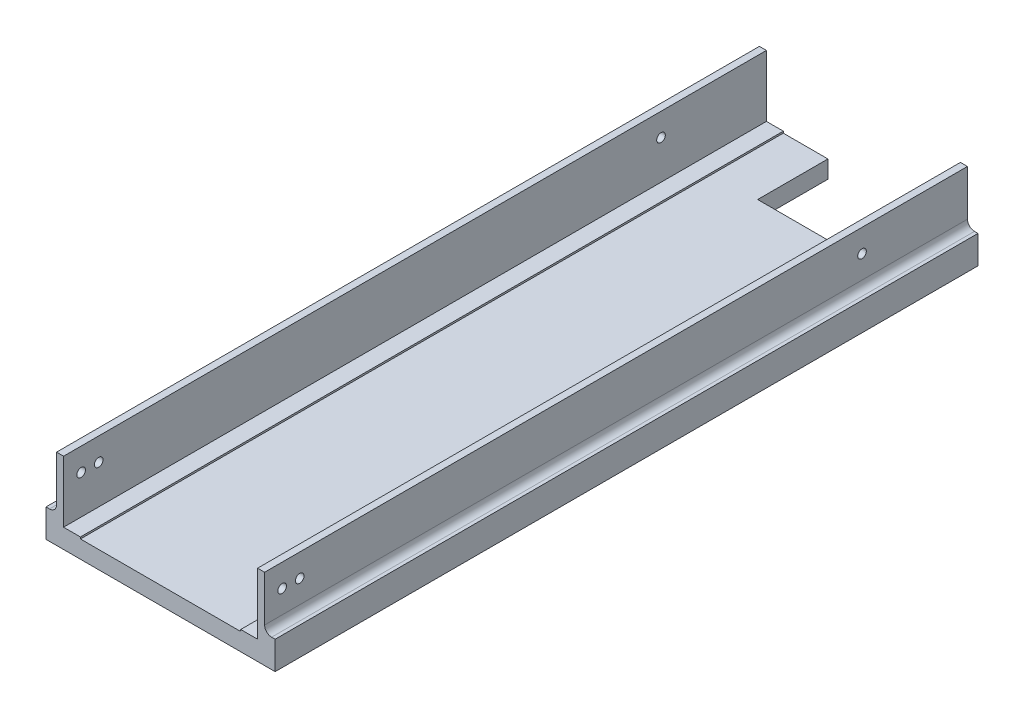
ISO-10303-21;
HEADER;
FILE_DESCRIPTION(('STEP AP214'),'2;1');
FILE_NAME('part.step','',(''),(''),'','','');
FILE_SCHEMA(('AUTOMOTIVE_DESIGN { 1 0 10303 214 1 1 1 1 }'));
ENDSEC;
DATA;
#1=APPLICATION_CONTEXT('core data for automotive mechanical design processes');
#2=APPLICATION_PROTOCOL_DEFINITION('international standard','automotive_design',2000,#1);
#3=PRODUCT_CONTEXT('',#1,'mechanical');
#4=PRODUCT('Part','Part','',(#3));
#5=PRODUCT_RELATED_PRODUCT_CATEGORY('part','',(#4));
#6=PRODUCT_DEFINITION_FORMATION('','',#4);
#7=PRODUCT_DEFINITION_CONTEXT('part definition',#1,'design');
#8=PRODUCT_DEFINITION('design','',#6,#7);
#9=PRODUCT_DEFINITION_SHAPE('','',#8);
#10=(LENGTH_UNIT() NAMED_UNIT(*) SI_UNIT(.MILLI.,.METRE.));
#11=(NAMED_UNIT(*) PLANE_ANGLE_UNIT() SI_UNIT($,.RADIAN.));
#12=(NAMED_UNIT(*) SI_UNIT($,.STERADIAN.) SOLID_ANGLE_UNIT());
#13=UNCERTAINTY_MEASURE_WITH_UNIT(LENGTH_MEASURE(1.E-05),#10,'distance_accuracy_value','');
#14=(GEOMETRIC_REPRESENTATION_CONTEXT(3) GLOBAL_UNCERTAINTY_ASSIGNED_CONTEXT((#13)) GLOBAL_UNIT_ASSIGNED_CONTEXT((#10,
#11,#12)) REPRESENTATION_CONTEXT('',''));
#15=CARTESIAN_POINT('',(0.,0.,0.));
#16=DIRECTION('',(0.,0.,1.));
#17=DIRECTION('',(1.,0.,0.));
#18=AXIS2_PLACEMENT_3D('',#15,#16,#17);
#19=CARTESIAN_POINT('',(9.8,13.,0.));
#20=DIRECTION('',(-1.,0.,0.));
#21=DIRECTION('',(0.,0.,1.));
#22=AXIS2_PLACEMENT_3D('',#19,#20,#21);
#23=PLANE('',#22);
#24=DIRECTION('',(0.,0.,-1.));
#25=VECTOR('',#24,1.);
#26=CARTESIAN_POINT('',(9.8,4.99999999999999,0.));
#27=LINE('',#26,#25);
#28=CARTESIAN_POINT('',(9.80000000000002,4.99999999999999,400.));
#29=VERTEX_POINT('',#28);
#30=CARTESIAN_POINT('',(9.80000000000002,4.99999999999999,200.));
#31=VERTEX_POINT('',#30);
#32=EDGE_CURVE('E310',#29,#31,#27,.T.);
#33=ORIENTED_EDGE('',*,*,#32,.T.);
#34=DIRECTION('',(0.,1.,0.));
#35=VECTOR('',#34,1.);
#36=CARTESIAN_POINT('',(9.80000000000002,13.,200.));
#37=LINE('',#36,#35);
#38=CARTESIAN_POINT('',(9.80000000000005,5.49999999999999,200.));
#39=VERTEX_POINT('',#38);
#40=EDGE_CURVE('E360',#31,#39,#37,.T.);
#41=ORIENTED_EDGE('',*,*,#40,.T.);
#42=DIRECTION('',(0.,0.,-1.));
#43=VECTOR('',#42,1.);
#44=CARTESIAN_POINT('',(9.80000000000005,5.49999999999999,0.));
#45=LINE('',#44,#43);
#46=CARTESIAN_POINT('',(9.80000000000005,5.49999999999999,400.));
#47=VERTEX_POINT('',#46);
#48=EDGE_CURVE('E229',#47,#39,#45,.T.);
#49=ORIENTED_EDGE('',*,*,#48,.F.);
#50=DIRECTION('',(0.,-1.,0.));
#51=VECTOR('',#50,1.);
#52=CARTESIAN_POINT('',(9.80000000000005,13.,400.));
#53=LINE('',#52,#51);
#54=EDGE_CURVE('E313',#47,#29,#53,.T.);
#55=ORIENTED_EDGE('',*,*,#54,.T.);
#56=EDGE_LOOP('',(#33,#41,#49,#55));
#57=FACE_BOUND('',#56,.T.);
#58=ADVANCED_FACE('F38',(#57),#23,.F.);
#59=CARTESIAN_POINT('',(5.,4.99999999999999,400.));
#60=DIRECTION('',(0.,-1.,0.));
#61=DIRECTION('',(0.,0.,-1.));
#62=AXIS2_PLACEMENT_3D('',#59,#60,#61);
#63=PLANE('',#62);
#64=DIRECTION('',(0.,0.,1.));
#65=VECTOR('',#64,1.);
#66=CARTESIAN_POINT('',(55.4,4.99999999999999,0.));
#67=LINE('',#66,#65);
#68=CARTESIAN_POINT('',(55.4,4.99999999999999,200.));
#69=VERTEX_POINT('',#68);
#70=CARTESIAN_POINT('',(55.4,4.99999999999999,400.));
#71=VERTEX_POINT('',#70);
#72=EDGE_CURVE('E308',#69,#71,#67,.T.);
#73=ORIENTED_EDGE('',*,*,#72,.F.);
#74=DIRECTION('',(-1.,0.,0.));
#75=VECTOR('',#74,1.);
#76=CARTESIAN_POINT('',(5.,4.99999999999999,200.));
#77=LINE('',#76,#75);
#78=CARTESIAN_POINT('',(42.7,4.99999999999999,200.));
#79=VERTEX_POINT('',#78);
#80=EDGE_CURVE('E381',#69,#79,#77,.T.);
#81=ORIENTED_EDGE('',*,*,#80,.T.);
#82=DIRECTION('',(0.,0.,-1.));
#83=VECTOR('',#82,1.);
#84=CARTESIAN_POINT('',(42.6999999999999,4.99999999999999,400.));
#85=LINE('',#84,#83);
#86=CARTESIAN_POINT('',(42.7,4.99999999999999,220.));
#87=VERTEX_POINT('',#86);
#88=EDGE_CURVE('E390',#87,#79,#85,.T.);
#89=ORIENTED_EDGE('',*,*,#88,.F.);
#90=DIRECTION('',(-1.,0.,0.));
#91=VECTOR('',#90,1.);
#92=CARTESIAN_POINT('',(5.,4.99999999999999,220.));
#93=LINE('',#92,#91);
#94=CARTESIAN_POINT('',(22.5,4.99999999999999,220.));
#95=VERTEX_POINT('',#94);
#96=EDGE_CURVE('E387',#87,#95,#93,.T.);
#97=ORIENTED_EDGE('',*,*,#96,.T.);
#98=DIRECTION('',(0.,0.,-1.));
#99=VECTOR('',#98,1.);
#100=CARTESIAN_POINT('',(22.5,4.99999999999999,400.));
#101=LINE('',#100,#99);
#102=CARTESIAN_POINT('',(22.5,4.99999999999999,200.));
#103=VERTEX_POINT('',#102);
#104=EDGE_CURVE('E384',#95,#103,#101,.T.);
#105=ORIENTED_EDGE('',*,*,#104,.T.);
#106=DIRECTION('',(-1.,0.,0.));
#107=VECTOR('',#106,1.);
#108=CARTESIAN_POINT('',(5.,4.99999999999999,200.));
#109=LINE('',#108,#107);
#110=EDGE_CURVE('E363',#103,#31,#109,.T.);
#111=ORIENTED_EDGE('',*,*,#110,.T.);
#112=ORIENTED_EDGE('',*,*,#32,.F.);
#113=DIRECTION('',(-1.,0.,0.));
#114=VECTOR('',#113,1.);
#115=CARTESIAN_POINT('',(5.,4.99999999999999,400.));
#116=LINE('',#115,#114);
#117=EDGE_CURVE('E330',#71,#29,#116,.T.);
#118=ORIENTED_EDGE('',*,*,#117,.F.);
#119=EDGE_LOOP('',(#73,#81,#89,#97,#105,#111,#112,#118));
#120=FACE_BOUND('',#119,.T.);
#121=ADVANCED_FACE('F433',(#120),#63,.F.);
#122=CARTESIAN_POINT('',(5.,25.,400.));
#123=DIRECTION('',(-1.,0.,0.));
#124=DIRECTION('',(0.,-1.,0.));
#125=AXIS2_PLACEMENT_3D('',#122,#123,#124);
#126=PLANE('',#125);
#127=CARTESIAN_POINT('',(5.,16.5,230.));
#128=DIRECTION('',(-1.,0.,0.));
#129=DIRECTION('',(0.,-1.,0.));
#130=AXIS2_PLACEMENT_3D('',#127,#128,#129);
#131=CIRCLE('',#130,1.225);
#132=CARTESIAN_POINT('',(5.,15.275,230.));
#133=VERTEX_POINT('',#132);
#134=EDGE_CURVE('E237',#133,#133,#131,.T.);
#135=ORIENTED_EDGE('',*,*,#134,.T.);
#136=EDGE_LOOP('',(#135));
#137=FACE_BOUND('',#136,.T.);
#138=CARTESIAN_POINT('',(5.,16.5,390.));
#139=DIRECTION('',(-1.,0.,0.));
#140=DIRECTION('',(0.,-1.,0.));
#141=AXIS2_PLACEMENT_3D('',#138,#139,#140);
#142=CIRCLE('',#141,1.225);
#143=CARTESIAN_POINT('',(5.,15.275,390.));
#144=VERTEX_POINT('',#143);
#145=EDGE_CURVE('E233',#144,#144,#142,.T.);
#146=ORIENTED_EDGE('',*,*,#145,.T.);
#147=EDGE_LOOP('',(#146));
#148=FACE_BOUND('',#147,.T.);
#149=CARTESIAN_POINT('',(5.,16.5,395.));
#150=DIRECTION('',(-1.,0.,0.));
#151=DIRECTION('',(0.,-1.,0.));
#152=AXIS2_PLACEMENT_3D('',#149,#150,#151);
#153=CIRCLE('',#152,1.225);
#154=CARTESIAN_POINT('',(5.,15.275,395.));
#155=VERTEX_POINT('',#154);
#156=EDGE_CURVE('E228',#155,#155,#153,.T.);
#157=ORIENTED_EDGE('',*,*,#156,.T.);
#158=EDGE_LOOP('',(#157));
#159=FACE_BOUND('',#158,.T.);
#160=DIRECTION('',(0.,0.,1.));
#161=VECTOR('',#160,1.);
#162=CARTESIAN_POINT('',(5.,5.49999999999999,0.));
#163=LINE('',#162,#161);
#164=CARTESIAN_POINT('',(5.,5.49999999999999,200.));
#165=VERTEX_POINT('',#164);
#166=CARTESIAN_POINT('',(5.,5.49999999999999,400.));
#167=VERTEX_POINT('',#166);
#168=EDGE_CURVE('E288',#165,#167,#163,.T.);
#169=ORIENTED_EDGE('',*,*,#168,.F.);
#170=DIRECTION('',(0.,1.,0.));
#171=VECTOR('',#170,1.);
#172=CARTESIAN_POINT('',(5.,25.,200.));
#173=LINE('',#172,#171);
#174=CARTESIAN_POINT('',(5.,23.,200.));
#175=VERTEX_POINT('',#174);
#176=EDGE_CURVE('E344',#165,#175,#173,.T.);
#177=ORIENTED_EDGE('',*,*,#176,.T.);
#178=DIRECTION('',(0.,0.,-1.));
#179=VECTOR('',#178,1.);
#180=CARTESIAN_POINT('',(5.,23.,400.));
#181=LINE('',#180,#179);
#182=CARTESIAN_POINT('',(5.,23.,400.));
#183=VERTEX_POINT('',#182);
#184=EDGE_CURVE('E320',#183,#175,#181,.T.);
#185=ORIENTED_EDGE('',*,*,#184,.F.);
#186=DIRECTION('',(0.,1.,0.));
#187=VECTOR('',#186,1.);
#188=CARTESIAN_POINT('',(5.,25.,400.));
#189=LINE('',#188,#187);
#190=EDGE_CURVE('E221',#167,#183,#189,.T.);
#191=ORIENTED_EDGE('',*,*,#190,.F.);
#192=EDGE_LOOP('',(#169,#177,#185,#191));
#193=FACE_BOUND('',#192,.T.);
#194=ADVANCED_FACE('F343',(#137,#148,#159,#193),#126,.F.);
#195=CARTESIAN_POINT('',(0.,0.,400.));
#196=DIRECTION('',(1.,0.,0.));
#197=DIRECTION('',(0.,0.,-1.));
#198=AXIS2_PLACEMENT_3D('',#195,#196,#197);
#199=PLANE('',#198);
#200=DIRECTION('',(0.,0.,-1.));
#201=VECTOR('',#200,1.);
#202=CARTESIAN_POINT('',(0.,7.99999999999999,400.));
#203=LINE('',#202,#201);
#204=CARTESIAN_POINT('',(0.,7.99999999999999,400.));
#205=VERTEX_POINT('',#204);
#206=CARTESIAN_POINT('',(0.,7.99999999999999,200.));
#207=VERTEX_POINT('',#206);
#208=EDGE_CURVE('E207',#205,#207,#203,.T.);
#209=ORIENTED_EDGE('',*,*,#208,.T.);
#210=DIRECTION('',(0.,1.,0.));
#211=VECTOR('',#210,1.);
#212=CARTESIAN_POINT('',(0.,0.,200.));
#213=LINE('',#212,#211);
#214=CARTESIAN_POINT('',(0.,0.,200.));
#215=VERTEX_POINT('',#214);
#216=EDGE_CURVE('E189',#215,#207,#213,.T.);
#217=ORIENTED_EDGE('',*,*,#216,.F.);
#218=DIRECTION('',(0.,0.,-1.));
#219=VECTOR('',#218,1.);
#220=CARTESIAN_POINT('',(0.,0.,400.));
#221=LINE('',#220,#219);
#222=CARTESIAN_POINT('',(0.,0.,400.));
#223=VERTEX_POINT('',#222);
#224=EDGE_CURVE('E204',#223,#215,#221,.T.);
#225=ORIENTED_EDGE('',*,*,#224,.F.);
#226=DIRECTION('',(0.,-1.,0.));
#227=VECTOR('',#226,1.);
#228=CARTESIAN_POINT('',(0.,0.,400.));
#229=LINE('',#228,#227);
#230=EDGE_CURVE('E216',#205,#223,#229,.T.);
#231=ORIENTED_EDGE('',*,*,#230,.F.);
#232=EDGE_LOOP('',(#209,#217,#225,#231));
#233=FACE_BOUND('',#232,.T.);
#234=ADVANCED_FACE('F202',(#233),#199,.F.);
#235=CARTESIAN_POINT('',(65.2,25.,400.));
#236=DIRECTION('',(-1.,0.,0.));
#237=DIRECTION('',(0.,0.,1.));
#238=AXIS2_PLACEMENT_3D('',#235,#236,#237);
#239=PLANE('',#238);
#240=DIRECTION('',(0.,0.,-1.));
#241=VECTOR('',#240,1.);
#242=CARTESIAN_POINT('',(65.2,0.,400.));
#243=LINE('',#242,#241);
#244=CARTESIAN_POINT('',(65.2,0.,400.));
#245=VERTEX_POINT('',#244);
#246=CARTESIAN_POINT('',(65.2,0.,200.));
#247=VERTEX_POINT('',#246);
#248=EDGE_CURVE('E215',#245,#247,#243,.T.);
#249=ORIENTED_EDGE('',*,*,#248,.T.);
#250=DIRECTION('',(0.,1.,0.));
#251=VECTOR('',#250,1.);
#252=CARTESIAN_POINT('',(65.2,0.,200.));
#253=LINE('',#252,#251);
#254=CARTESIAN_POINT('',(65.2,7.99999999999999,200.));
#255=VERTEX_POINT('',#254);
#256=EDGE_CURVE('E356',#247,#255,#253,.T.);
#257=ORIENTED_EDGE('',*,*,#256,.T.);
#258=DIRECTION('',(0.,0.,-1.));
#259=VECTOR('',#258,1.);
#260=CARTESIAN_POINT('',(65.2,7.99999999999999,400.));
#261=LINE('',#260,#259);
#262=CARTESIAN_POINT('',(65.2,7.99999999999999,400.));
#263=VERTEX_POINT('',#262);
#264=EDGE_CURVE('E395',#263,#255,#261,.T.);
#265=ORIENTED_EDGE('',*,*,#264,.F.);
#266=DIRECTION('',(0.,1.,0.));
#267=VECTOR('',#266,1.);
#268=CARTESIAN_POINT('',(65.2,25.,400.));
#269=LINE('',#268,#267);
#270=EDGE_CURVE('E325',#245,#263,#269,.T.);
#271=ORIENTED_EDGE('',*,*,#270,.F.);
#272=EDGE_LOOP('',(#249,#257,#265,#271));
#273=FACE_BOUND('',#272,.T.);
#274=ADVANCED_FACE('F405',(#273),#239,.F.);
#275=CARTESIAN_POINT('',(60.2,4.99999999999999,400.));
#276=DIRECTION('',(1.,0.,0.));
#277=DIRECTION('',(0.,0.,-1.));
#278=AXIS2_PLACEMENT_3D('',#275,#276,#277);
#279=PLANE('',#278);
#280=CARTESIAN_POINT('',(60.2,16.5,230.));
#281=DIRECTION('',(1.,0.,0.));
#282=DIRECTION('',(0.,0.,-1.));
#283=AXIS2_PLACEMENT_3D('',#280,#281,#282);
#284=CIRCLE('',#283,1.225);
#285=CARTESIAN_POINT('',(60.2,16.5,228.775));
#286=VERTEX_POINT('',#285);
#287=EDGE_CURVE('E234',#286,#286,#284,.T.);
#288=ORIENTED_EDGE('',*,*,#287,.T.);
#289=EDGE_LOOP('',(#288));
#290=FACE_BOUND('',#289,.T.);
#291=CARTESIAN_POINT('',(60.2,16.5,390.));
#292=DIRECTION('',(1.,0.,0.));
#293=DIRECTION('',(0.,0.,-1.));
#294=AXIS2_PLACEMENT_3D('',#291,#292,#293);
#295=CIRCLE('',#294,1.225);
#296=CARTESIAN_POINT('',(60.2,16.5,388.775));
#297=VERTEX_POINT('',#296);
#298=EDGE_CURVE('E230',#297,#297,#295,.T.);
#299=ORIENTED_EDGE('',*,*,#298,.T.);
#300=EDGE_LOOP('',(#299));
#301=FACE_BOUND('',#300,.T.);
#302=CARTESIAN_POINT('',(60.2,16.5,395.));
#303=DIRECTION('',(1.,0.,0.));
#304=DIRECTION('',(0.,0.,-1.));
#305=AXIS2_PLACEMENT_3D('',#302,#303,#304);
#306=CIRCLE('',#305,1.225);
#307=CARTESIAN_POINT('',(60.2,16.5,393.775));
#308=VERTEX_POINT('',#307);
#309=EDGE_CURVE('E225',#308,#308,#306,.T.);
#310=ORIENTED_EDGE('',*,*,#309,.T.);
#311=EDGE_LOOP('',(#310));
#312=FACE_BOUND('',#311,.T.);
#313=DIRECTION('',(0.,0.,1.));
#314=VECTOR('',#313,1.);
#315=CARTESIAN_POINT('',(60.2,23.,400.));
#316=LINE('',#315,#314);
#317=CARTESIAN_POINT('',(60.2,23.,200.));
#318=VERTEX_POINT('',#317);
#319=CARTESIAN_POINT('',(60.2,23.,400.));
#320=VERTEX_POINT('',#319);
#321=EDGE_CURVE('E315',#318,#320,#316,.T.);
#322=ORIENTED_EDGE('',*,*,#321,.F.);
#323=DIRECTION('',(0.,-1.,0.));
#324=VECTOR('',#323,1.);
#325=CARTESIAN_POINT('',(60.2,4.99999999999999,200.));
#326=LINE('',#325,#324);
#327=CARTESIAN_POINT('',(60.2,5.49999999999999,200.));
#328=VERTEX_POINT('',#327);
#329=EDGE_CURVE('E378',#318,#328,#326,.T.);
#330=ORIENTED_EDGE('',*,*,#329,.T.);
#331=DIRECTION('',(0.,0.,-1.));
#332=VECTOR('',#331,1.);
#333=CARTESIAN_POINT('',(60.2,5.49999999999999,400.));
#334=LINE('',#333,#332);
#335=CARTESIAN_POINT('',(60.2,5.49999999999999,400.));
#336=VERTEX_POINT('',#335);
#337=EDGE_CURVE('E287',#336,#328,#334,.T.);
#338=ORIENTED_EDGE('',*,*,#337,.F.);
#339=DIRECTION('',(0.,-1.,0.));
#340=VECTOR('',#339,1.);
#341=CARTESIAN_POINT('',(60.2,4.99999999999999,400.));
#342=LINE('',#341,#340);
#343=EDGE_CURVE('E328',#320,#336,#342,.T.);
#344=ORIENTED_EDGE('',*,*,#343,.F.);
#345=EDGE_LOOP('',(#322,#330,#338,#344));
#346=FACE_BOUND('',#345,.T.);
#347=ADVANCED_FACE('F457',(#290,#301,#312,#346),#279,.F.);
#348=CARTESIAN_POINT('',(0.,0.,400.));
#349=DIRECTION('',(0.,0.,-1.));
#350=DIRECTION('',(-1.,0.,0.));
#351=AXIS2_PLACEMENT_3D('',#348,#349,#350);
#352=PLANE('',#351);
#353=DIRECTION('',(-1.,0.,0.));
#354=VECTOR('',#353,1.);
#355=CARTESIAN_POINT('',(65.2,7.99999999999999,400.));
#356=LINE('',#355,#354);
#357=CARTESIAN_POINT('',(64.2,7.99999999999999,400.));
#358=VERTEX_POINT('',#357);
#359=EDGE_CURVE('E271',#263,#358,#356,.T.);
#360=ORIENTED_EDGE('',*,*,#359,.T.);
#361=CARTESIAN_POINT('',(64.2,9.99999999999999,400.));
#362=DIRECTION('',(0.,0.,-1.));
#363=DIRECTION('',(-1.,0.,0.));
#364=AXIS2_PLACEMENT_3D('',#361,#362,#363);
#365=CIRCLE('',#364,2.);
#366=CARTESIAN_POINT('',(62.2,9.99999999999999,400.));
#367=VERTEX_POINT('',#366);
#368=EDGE_CURVE('E253',#358,#367,#365,.T.);
#369=ORIENTED_EDGE('',*,*,#368,.T.);
#370=DIRECTION('',(0.,1.,0.));
#371=VECTOR('',#370,1.);
#372=CARTESIAN_POINT('',(62.2,23.,400.));
#373=LINE('',#372,#371);
#374=CARTESIAN_POINT('',(62.2,23.,400.));
#375=VERTEX_POINT('',#374);
#376=EDGE_CURVE('E393',#367,#375,#373,.T.);
#377=ORIENTED_EDGE('',*,*,#376,.T.);
#378=DIRECTION('',(1.,0.,0.));
#379=VECTOR('',#378,1.);
#380=CARTESIAN_POINT('',(0.,23.,400.));
#381=LINE('',#380,#379);
#382=EDGE_CURVE('E317',#320,#375,#381,.T.);
#383=ORIENTED_EDGE('',*,*,#382,.F.);
#384=ORIENTED_EDGE('',*,*,#343,.T.);
#385=DIRECTION('',(1.,0.,0.));
#386=VECTOR('',#385,1.);
#387=CARTESIAN_POINT('',(55.4,5.49999999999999,400.));
#388=LINE('',#387,#386);
#389=CARTESIAN_POINT('',(55.4,5.49999999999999,400.));
#390=VERTEX_POINT('',#389);
#391=EDGE_CURVE('E297',#390,#336,#388,.T.);
#392=ORIENTED_EDGE('',*,*,#391,.F.);
#393=DIRECTION('',(0.,-1.,0.));
#394=VECTOR('',#393,1.);
#395=CARTESIAN_POINT('',(55.4,13.,400.));
#396=LINE('',#395,#394);
#397=EDGE_CURVE('E305',#390,#71,#396,.T.);
#398=ORIENTED_EDGE('',*,*,#397,.T.);
#399=ORIENTED_EDGE('',*,*,#117,.T.);
#400=ORIENTED_EDGE('',*,*,#54,.F.);
#401=DIRECTION('',(1.,0.,0.));
#402=VECTOR('',#401,1.);
#403=CARTESIAN_POINT('',(5.,5.49999999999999,400.));
#404=LINE('',#403,#402);
#405=EDGE_CURVE('E290',#167,#47,#404,.T.);
#406=ORIENTED_EDGE('',*,*,#405,.F.);
#407=ORIENTED_EDGE('',*,*,#190,.T.);
#408=CARTESIAN_POINT('',(3.,23.,400.));
#409=VERTEX_POINT('',#408);
#410=EDGE_CURVE('E321',#409,#183,#381,.T.);
#411=ORIENTED_EDGE('',*,*,#410,.F.);
#412=DIRECTION('',(0.,-1.,0.));
#413=VECTOR('',#412,1.);
#414=CARTESIAN_POINT('',(3.,23.,400.));
#415=LINE('',#414,#413);
#416=CARTESIAN_POINT('',(3.,9.99999999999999,400.));
#417=VERTEX_POINT('',#416);
#418=EDGE_CURVE('E268',#409,#417,#415,.T.);
#419=ORIENTED_EDGE('',*,*,#418,.T.);
#420=CARTESIAN_POINT('',(0.999999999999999,9.99999999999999,400.));
#421=DIRECTION('',(0.,0.,-1.));
#422=DIRECTION('',(-1.,0.,0.));
#423=AXIS2_PLACEMENT_3D('',#420,#421,#422);
#424=CIRCLE('',#423,2.);
#425=CARTESIAN_POINT('',(0.999999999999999,7.99999999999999,400.));
#426=VERTEX_POINT('',#425);
#427=EDGE_CURVE('E259',#417,#426,#424,.T.);
#428=ORIENTED_EDGE('',*,*,#427,.T.);
#429=DIRECTION('',(-1.,0.,0.));
#430=VECTOR('',#429,1.);
#431=CARTESIAN_POINT('',(0.,7.99999999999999,400.));
#432=LINE('',#431,#430);
#433=EDGE_CURVE('E266',#426,#205,#432,.T.);
#434=ORIENTED_EDGE('',*,*,#433,.T.);
#435=ORIENTED_EDGE('',*,*,#230,.T.);
#436=DIRECTION('',(1.,0.,0.));
#437=VECTOR('',#436,1.);
#438=CARTESIAN_POINT('',(65.2,0.,400.));
#439=LINE('',#438,#437);
#440=EDGE_CURVE('E214',#223,#245,#439,.T.);
#441=ORIENTED_EDGE('',*,*,#440,.T.);
#442=ORIENTED_EDGE('',*,*,#270,.T.);
#443=EDGE_LOOP('',(#360,#369,#377,#383,#384,#392,#398,#399,#400,#406,#407,#411,#419,#428,#434,
#435,#441,#442));
#444=FACE_BOUND('',#443,.T.);
#445=ADVANCED_FACE('F338',(#444),#352,.F.);
#446=CARTESIAN_POINT('',(65.2,0.,400.));
#447=DIRECTION('',(0.,1.,0.));
#448=DIRECTION('',(0.,0.,1.));
#449=AXIS2_PLACEMENT_3D('',#446,#447,#448);
#450=PLANE('',#449);
#451=DIRECTION('',(0.,0.,1.));
#452=VECTOR('',#451,1.);
#453=CARTESIAN_POINT('',(42.7000000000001,0.,0.));
#454=LINE('',#453,#452);
#455=CARTESIAN_POINT('',(42.7,0.,200.));
#456=VERTEX_POINT('',#455);
#457=CARTESIAN_POINT('',(42.7,0.,220.));
#458=VERTEX_POINT('',#457);
#459=EDGE_CURVE('E410',#456,#458,#454,.T.);
#460=ORIENTED_EDGE('',*,*,#459,.F.);
#461=DIRECTION('',(1.,0.,0.));
#462=VECTOR('',#461,1.);
#463=CARTESIAN_POINT('',(0.,0.,200.));
#464=LINE('',#463,#462);
#465=EDGE_CURVE('E208',#456,#247,#464,.T.);
#466=ORIENTED_EDGE('',*,*,#465,.T.);
#467=ORIENTED_EDGE('',*,*,#248,.F.);
#468=ORIENTED_EDGE('',*,*,#440,.F.);
#469=ORIENTED_EDGE('',*,*,#224,.T.);
#470=DIRECTION('',(1.,0.,0.));
#471=VECTOR('',#470,1.);
#472=CARTESIAN_POINT('',(0.,0.,200.));
#473=LINE('',#472,#471);
#474=CARTESIAN_POINT('',(22.5,0.,200.));
#475=VERTEX_POINT('',#474);
#476=EDGE_CURVE('E186',#215,#475,#473,.T.);
#477=ORIENTED_EDGE('',*,*,#476,.T.);
#478=DIRECTION('',(0.,0.,1.));
#479=VECTOR('',#478,1.);
#480=CARTESIAN_POINT('',(22.4999999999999,0.,0.));
#481=LINE('',#480,#479);
#482=CARTESIAN_POINT('',(22.5,0.,220.));
#483=VERTEX_POINT('',#482);
#484=EDGE_CURVE('E196',#475,#483,#481,.T.);
#485=ORIENTED_EDGE('',*,*,#484,.T.);
#486=DIRECTION('',(1.,0.,0.));
#487=VECTOR('',#486,1.);
#488=CARTESIAN_POINT('',(0.,0.,220.));
#489=LINE('',#488,#487);
#490=EDGE_CURVE('E414',#483,#458,#489,.T.);
#491=ORIENTED_EDGE('',*,*,#490,.T.);
#492=EDGE_LOOP('',(#460,#466,#467,#468,#469,#477,#485,#491));
#493=FACE_BOUND('',#492,.T.);
#494=ADVANCED_FACE('F211',(#493),#450,.F.);
#495=CARTESIAN_POINT('',(0.,23.,0.));
#496=DIRECTION('',(0.,1.,0.));
#497=DIRECTION('',(0.,0.,1.));
#498=AXIS2_PLACEMENT_3D('',#495,#496,#497);
#499=PLANE('',#498);
#500=DIRECTION('',(1.,0.,0.));
#501=VECTOR('',#500,1.);
#502=CARTESIAN_POINT('',(0.,23.,200.));
#503=LINE('',#502,#501);
#504=CARTESIAN_POINT('',(62.2,23.,200.));
#505=VERTEX_POINT('',#504);
#506=EDGE_CURVE('E197',#318,#505,#503,.T.);
#507=ORIENTED_EDGE('',*,*,#506,.F.);
#508=ORIENTED_EDGE('',*,*,#321,.T.);
#509=ORIENTED_EDGE('',*,*,#382,.T.);
#510=DIRECTION('',(0.,0.,-1.));
#511=VECTOR('',#510,1.);
#512=CARTESIAN_POINT('',(62.2,23.,400.));
#513=LINE('',#512,#511);
#514=EDGE_CURVE('E243',#375,#505,#513,.T.);
#515=ORIENTED_EDGE('',*,*,#514,.T.);
#516=EDGE_LOOP('',(#507,#508,#509,#515));
#517=FACE_BOUND('',#516,.T.);
#518=ADVANCED_FACE('F459',(#517),#499,.T.);
#519=DIRECTION('',(1.,0.,0.));
#520=VECTOR('',#519,1.);
#521=CARTESIAN_POINT('',(0.,23.,200.));
#522=LINE('',#521,#520);
#523=CARTESIAN_POINT('',(3.,23.,200.));
#524=VERTEX_POINT('',#523);
#525=EDGE_CURVE('E349',#524,#175,#522,.T.);
#526=ORIENTED_EDGE('',*,*,#525,.F.);
#527=DIRECTION('',(0.,0.,-1.));
#528=VECTOR('',#527,1.);
#529=CARTESIAN_POINT('',(3.,23.,400.));
#530=LINE('',#529,#528);
#531=EDGE_CURVE('E269',#409,#524,#530,.T.);
#532=ORIENTED_EDGE('',*,*,#531,.F.);
#533=ORIENTED_EDGE('',*,*,#410,.T.);
#534=ORIENTED_EDGE('',*,*,#184,.T.);
#535=EDGE_LOOP('',(#526,#532,#533,#534));
#536=FACE_BOUND('',#535,.T.);
#537=ADVANCED_FACE('F347',(#536),#499,.T.);
#538=CARTESIAN_POINT('',(55.4,13.,0.));
#539=DIRECTION('',(1.,0.,0.));
#540=DIRECTION('',(0.,0.,-1.));
#541=AXIS2_PLACEMENT_3D('',#538,#539,#540);
#542=PLANE('',#541);
#543=DIRECTION('',(0.,0.,1.));
#544=VECTOR('',#543,1.);
#545=CARTESIAN_POINT('',(55.4,5.49999999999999,400.));
#546=LINE('',#545,#544);
#547=CARTESIAN_POINT('',(55.4,5.49999999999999,200.));
#548=VERTEX_POINT('',#547);
#549=EDGE_CURVE('E291',#548,#390,#546,.T.);
#550=ORIENTED_EDGE('',*,*,#549,.F.);
#551=DIRECTION('',(0.,-1.,0.));
#552=VECTOR('',#551,1.);
#553=CARTESIAN_POINT('',(55.4,13.,200.));
#554=LINE('',#553,#552);
#555=EDGE_CURVE('E375',#548,#69,#554,.T.);
#556=ORIENTED_EDGE('',*,*,#555,.T.);
#557=ORIENTED_EDGE('',*,*,#72,.T.);
#558=ORIENTED_EDGE('',*,*,#397,.F.);
#559=EDGE_LOOP('',(#550,#556,#557,#558));
#560=FACE_BOUND('',#559,.T.);
#561=ADVANCED_FACE('F447',(#560),#542,.F.);
#562=CARTESIAN_POINT('',(65.2,16.5,395.));
#563=DIRECTION('',(-1.,0.,0.));
#564=DIRECTION('',(0.,0.,1.));
#565=AXIS2_PLACEMENT_3D('',#562,#563,#564);
#566=CYLINDRICAL_SURFACE('',#565,1.225);
#567=CARTESIAN_POINT('',(62.2,16.5,395.));
#568=DIRECTION('',(-1.,0.,0.));
#569=DIRECTION('',(0.,0.,1.));
#570=AXIS2_PLACEMENT_3D('',#567,#568,#569);
#571=CIRCLE('',#570,1.225);
#572=CARTESIAN_POINT('',(62.2,16.5,396.225));
#573=VERTEX_POINT('',#572);
#574=EDGE_CURVE('E238',#573,#573,#571,.F.);
#575=ORIENTED_EDGE('',*,*,#574,.T.);
#576=EDGE_LOOP('',(#575));
#577=FACE_BOUND('',#576,.T.);
#578=ORIENTED_EDGE('',*,*,#309,.F.);
#579=EDGE_LOOP('',(#578));
#580=FACE_BOUND('',#579,.T.);
#581=ADVANCED_FACE('F516',(#577,#580),#566,.F.);
#582=CARTESIAN_POINT('',(65.2,16.5,390.));
#583=DIRECTION('',(-1.,0.,0.));
#584=DIRECTION('',(0.,0.,1.));
#585=AXIS2_PLACEMENT_3D('',#582,#583,#584);
#586=CYLINDRICAL_SURFACE('',#585,1.225);
#587=CARTESIAN_POINT('',(62.2,16.5,390.));
#588=DIRECTION('',(-1.,0.,0.));
#589=DIRECTION('',(0.,0.,1.));
#590=AXIS2_PLACEMENT_3D('',#587,#588,#589);
#591=CIRCLE('',#590,1.225);
#592=CARTESIAN_POINT('',(62.2,16.5,391.225));
#593=VERTEX_POINT('',#592);
#594=EDGE_CURVE('E247',#593,#593,#591,.F.);
#595=ORIENTED_EDGE('',*,*,#594,.T.);
#596=EDGE_LOOP('',(#595));
#597=FACE_BOUND('',#596,.T.);
#598=ORIENTED_EDGE('',*,*,#298,.F.);
#599=EDGE_LOOP('',(#598));
#600=FACE_BOUND('',#599,.T.);
#601=ADVANCED_FACE('F722',(#597,#600),#586,.F.);
#602=CARTESIAN_POINT('',(3.,16.5,395.));
#603=DIRECTION('',(1.,0.,0.));
#604=DIRECTION('',(0.,1.,0.));
#605=AXIS2_PLACEMENT_3D('',#602,#603,#604);
#606=CIRCLE('',#605,1.225);
#607=CARTESIAN_POINT('',(3.,17.725,395.));
#608=VERTEX_POINT('',#607);
#609=EDGE_CURVE('E248',#608,#608,#606,.F.);
#610=ORIENTED_EDGE('',*,*,#609,.T.);
#611=EDGE_LOOP('',(#610));
#612=FACE_BOUND('',#611,.T.);
#613=ORIENTED_EDGE('',*,*,#156,.F.);
#614=EDGE_LOOP('',(#613));
#615=FACE_BOUND('',#614,.T.);
#616=ADVANCED_FACE('F719',(#612,#615),#566,.F.);
#617=CARTESIAN_POINT('',(3.,16.5,390.));
#618=DIRECTION('',(1.,0.,0.));
#619=DIRECTION('',(0.,1.,0.));
#620=AXIS2_PLACEMENT_3D('',#617,#618,#619);
#621=CIRCLE('',#620,1.225);
#622=CARTESIAN_POINT('',(3.,17.725,390.));
#623=VERTEX_POINT('',#622);
#624=EDGE_CURVE('E242',#623,#623,#621,.F.);
#625=ORIENTED_EDGE('',*,*,#624,.T.);
#626=EDGE_LOOP('',(#625));
#627=FACE_BOUND('',#626,.T.);
#628=ORIENTED_EDGE('',*,*,#145,.F.);
#629=EDGE_LOOP('',(#628));
#630=FACE_BOUND('',#629,.T.);
#631=ADVANCED_FACE('F526',(#627,#630),#586,.F.);
#632=CARTESIAN_POINT('',(0.,5.49999999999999,0.));
#633=DIRECTION('',(0.,1.,0.));
#634=DIRECTION('',(0.,0.,1.));
#635=AXIS2_PLACEMENT_3D('',#632,#633,#634);
#636=PLANE('',#635);
#637=DIRECTION('',(1.,0.,0.));
#638=VECTOR('',#637,1.);
#639=CARTESIAN_POINT('',(0.,5.49999999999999,200.));
#640=LINE('',#639,#638);
#641=EDGE_CURVE('E353',#165,#39,#640,.T.);
#642=ORIENTED_EDGE('',*,*,#641,.F.);
#643=ORIENTED_EDGE('',*,*,#168,.T.);
#644=ORIENTED_EDGE('',*,*,#405,.T.);
#645=ORIENTED_EDGE('',*,*,#48,.T.);
#646=EDGE_LOOP('',(#642,#643,#644,#645));
#647=FACE_BOUND('',#646,.T.);
#648=ADVANCED_FACE('F520',(#647),#636,.T.);
#649=CARTESIAN_POINT('',(0.,5.49999999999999,0.));
#650=DIRECTION('',(0.,-1.,0.));
#651=DIRECTION('',(0.,0.,-1.));
#652=AXIS2_PLACEMENT_3D('',#649,#650,#651);
#653=PLANE('',#652);
#654=ORIENTED_EDGE('',*,*,#337,.T.);
#655=DIRECTION('',(-1.,0.,0.));
#656=VECTOR('',#655,1.);
#657=CARTESIAN_POINT('',(0.,5.49999999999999,200.));
#658=LINE('',#657,#656);
#659=EDGE_CURVE('E372',#328,#548,#658,.T.);
#660=ORIENTED_EDGE('',*,*,#659,.T.);
#661=ORIENTED_EDGE('',*,*,#549,.T.);
#662=ORIENTED_EDGE('',*,*,#391,.T.);
#663=EDGE_LOOP('',(#654,#660,#661,#662));
#664=FACE_BOUND('',#663,.T.);
#665=ADVANCED_FACE('F453',(#664),#653,.F.);
#666=CARTESIAN_POINT('',(65.2,16.5,230.));
#667=DIRECTION('',(-1.,0.,0.));
#668=DIRECTION('',(0.,0.,1.));
#669=AXIS2_PLACEMENT_3D('',#666,#667,#668);
#670=CYLINDRICAL_SURFACE('',#669,1.225);
#671=CARTESIAN_POINT('',(62.2,16.5,230.));
#672=DIRECTION('',(-1.,0.,0.));
#673=DIRECTION('',(0.,0.,1.));
#674=AXIS2_PLACEMENT_3D('',#671,#672,#673);
#675=CIRCLE('',#674,1.225);
#676=CARTESIAN_POINT('',(62.2,16.5,231.225));
#677=VERTEX_POINT('',#676);
#678=EDGE_CURVE('E244',#677,#677,#675,.F.);
#679=ORIENTED_EDGE('',*,*,#678,.T.);
#680=EDGE_LOOP('',(#679));
#681=FACE_BOUND('',#680,.T.);
#682=ORIENTED_EDGE('',*,*,#287,.F.);
#683=EDGE_LOOP('',(#682));
#684=FACE_BOUND('',#683,.T.);
#685=ADVANCED_FACE('F540',(#681,#684),#670,.F.);
#686=CARTESIAN_POINT('',(3.,16.5,230.));
#687=DIRECTION('',(1.,0.,0.));
#688=DIRECTION('',(0.,1.,0.));
#689=AXIS2_PLACEMENT_3D('',#686,#687,#688);
#690=CIRCLE('',#689,1.225);
#691=CARTESIAN_POINT('',(3.,17.725,230.));
#692=VERTEX_POINT('',#691);
#693=EDGE_CURVE('E239',#692,#692,#690,.F.);
#694=ORIENTED_EDGE('',*,*,#693,.T.);
#695=EDGE_LOOP('',(#694));
#696=FACE_BOUND('',#695,.T.);
#697=ORIENTED_EDGE('',*,*,#134,.F.);
#698=EDGE_LOOP('',(#697));
#699=FACE_BOUND('',#698,.T.);
#700=ADVANCED_FACE('F553',(#696,#699),#670,.F.);
#701=CARTESIAN_POINT('',(3.,23.,400.));
#702=DIRECTION('',(1.,0.,0.));
#703=DIRECTION('',(0.,1.,0.));
#704=AXIS2_PLACEMENT_3D('',#701,#702,#703);
#705=PLANE('',#704);
#706=ORIENTED_EDGE('',*,*,#624,.F.);
#707=EDGE_LOOP('',(#706));
#708=FACE_BOUND('',#707,.T.);
#709=ORIENTED_EDGE('',*,*,#693,.F.);
#710=EDGE_LOOP('',(#709));
#711=FACE_BOUND('',#710,.T.);
#712=ORIENTED_EDGE('',*,*,#531,.T.);
#713=DIRECTION('',(0.,-1.,0.));
#714=VECTOR('',#713,1.);
#715=CARTESIAN_POINT('',(3.,23.,200.));
#716=LINE('',#715,#714);
#717=CARTESIAN_POINT('',(3.,9.99999999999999,200.));
#718=VERTEX_POINT('',#717);
#719=EDGE_CURVE('E352',#524,#718,#716,.T.);
#720=ORIENTED_EDGE('',*,*,#719,.T.);
#721=DIRECTION('',(0.,0.,-1.));
#722=VECTOR('',#721,1.);
#723=CARTESIAN_POINT('',(3.,9.99999999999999,400.));
#724=LINE('',#723,#722);
#725=EDGE_CURVE('E61',#718,#417,#724,.F.);
#726=ORIENTED_EDGE('',*,*,#725,.T.);
#727=ORIENTED_EDGE('',*,*,#418,.F.);
#728=EDGE_LOOP('',(#712,#720,#726,#727));
#729=FACE_BOUND('',#728,.T.);
#730=ORIENTED_EDGE('',*,*,#609,.F.);
#731=EDGE_LOOP('',(#730));
#732=FACE_BOUND('',#731,.T.);
#733=ADVANCED_FACE('F350',(#708,#711,#729,#732),#705,.F.);
#734=CARTESIAN_POINT('',(0.,7.99999999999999,400.));
#735=DIRECTION('',(0.,-1.,0.));
#736=DIRECTION('',(0.,0.,-1.));
#737=AXIS2_PLACEMENT_3D('',#734,#735,#736);
#738=PLANE('',#737);
#739=DIRECTION('',(0.,0.,-1.));
#740=VECTOR('',#739,1.);
#741=CARTESIAN_POINT('',(0.999999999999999,7.99999999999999,0.));
#742=LINE('',#741,#740);
#743=CARTESIAN_POINT('',(0.999999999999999,7.99999999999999,200.));
#744=VERTEX_POINT('',#743);
#745=EDGE_CURVE('E255',#426,#744,#742,.T.);
#746=ORIENTED_EDGE('',*,*,#745,.T.);
#747=DIRECTION('',(-1.,0.,0.));
#748=VECTOR('',#747,1.);
#749=CARTESIAN_POINT('',(0.,7.99999999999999,200.));
#750=LINE('',#749,#748);
#751=EDGE_CURVE('E53',#744,#207,#750,.T.);
#752=ORIENTED_EDGE('',*,*,#751,.T.);
#753=ORIENTED_EDGE('',*,*,#208,.F.);
#754=ORIENTED_EDGE('',*,*,#433,.F.);
#755=EDGE_LOOP('',(#746,#752,#753,#754));
#756=FACE_BOUND('',#755,.T.);
#757=ADVANCED_FACE('F265',(#756),#738,.F.);
#758=CARTESIAN_POINT('',(62.2,23.,400.));
#759=DIRECTION('',(-1.,0.,0.));
#760=DIRECTION('',(0.,0.,1.));
#761=AXIS2_PLACEMENT_3D('',#758,#759,#760);
#762=PLANE('',#761);
#763=ORIENTED_EDGE('',*,*,#594,.F.);
#764=EDGE_LOOP('',(#763));
#765=FACE_BOUND('',#764,.T.);
#766=ORIENTED_EDGE('',*,*,#678,.F.);
#767=EDGE_LOOP('',(#766));
#768=FACE_BOUND('',#767,.T.);
#769=DIRECTION('',(0.,0.,-1.));
#770=VECTOR('',#769,1.);
#771=CARTESIAN_POINT('',(62.2,9.99999999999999,0.));
#772=LINE('',#771,#770);
#773=CARTESIAN_POINT('',(62.2,9.99999999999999,200.));
#774=VERTEX_POINT('',#773);
#775=EDGE_CURVE('E219',#367,#774,#772,.T.);
#776=ORIENTED_EDGE('',*,*,#775,.T.);
#777=DIRECTION('',(0.,1.,0.));
#778=VECTOR('',#777,1.);
#779=CARTESIAN_POINT('',(62.2,23.,200.));
#780=LINE('',#779,#778);
#781=EDGE_CURVE('E369',#774,#505,#780,.T.);
#782=ORIENTED_EDGE('',*,*,#781,.T.);
#783=ORIENTED_EDGE('',*,*,#514,.F.);
#784=ORIENTED_EDGE('',*,*,#376,.F.);
#785=EDGE_LOOP('',(#776,#782,#783,#784));
#786=FACE_BOUND('',#785,.T.);
#787=ORIENTED_EDGE('',*,*,#574,.F.);
#788=EDGE_LOOP('',(#787));
#789=FACE_BOUND('',#788,.T.);
#790=ADVANCED_FACE('F464',(#765,#768,#786,#789),#762,.F.);
#791=CARTESIAN_POINT('',(65.2,7.99999999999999,400.));
#792=DIRECTION('',(0.,-1.,0.));
#793=DIRECTION('',(0.,0.,-1.));
#794=AXIS2_PLACEMENT_3D('',#791,#792,#793);
#795=PLANE('',#794);
#796=ORIENTED_EDGE('',*,*,#264,.T.);
#797=DIRECTION('',(-1.,0.,0.));
#798=VECTOR('',#797,1.);
#799=CARTESIAN_POINT('',(65.2,7.99999999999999,200.));
#800=LINE('',#799,#798);
#801=CARTESIAN_POINT('',(64.2,7.99999999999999,200.));
#802=VERTEX_POINT('',#801);
#803=EDGE_CURVE('E366',#255,#802,#800,.T.);
#804=ORIENTED_EDGE('',*,*,#803,.T.);
#805=DIRECTION('',(0.,0.,-1.));
#806=VECTOR('',#805,1.);
#807=CARTESIAN_POINT('',(64.2,7.99999999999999,400.));
#808=LINE('',#807,#806);
#809=EDGE_CURVE('E251',#802,#358,#808,.F.);
#810=ORIENTED_EDGE('',*,*,#809,.T.);
#811=ORIENTED_EDGE('',*,*,#359,.F.);
#812=EDGE_LOOP('',(#796,#804,#810,#811));
#813=FACE_BOUND('',#812,.T.);
#814=ADVANCED_FACE('F401',(#813),#795,.F.);
#815=CARTESIAN_POINT('',(64.2,9.99999999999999,400.));
#816=DIRECTION('',(0.,0.,1.));
#817=DIRECTION('',(1.,0.,0.));
#818=AXIS2_PLACEMENT_3D('',#815,#816,#817);
#819=CYLINDRICAL_SURFACE('',#818,2.);
#820=ORIENTED_EDGE('',*,*,#809,.F.);
#821=CARTESIAN_POINT('',(64.2,9.99999999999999,200.));
#822=DIRECTION('',(0.,0.,1.));
#823=DIRECTION('',(1.,0.,0.));
#824=AXIS2_PLACEMENT_3D('',#821,#822,#823);
#825=CIRCLE('',#824,2.);
#826=EDGE_CURVE('E11',#802,#774,#825,.F.);
#827=ORIENTED_EDGE('',*,*,#826,.T.);
#828=ORIENTED_EDGE('',*,*,#775,.F.);
#829=ORIENTED_EDGE('',*,*,#368,.F.);
#830=EDGE_LOOP('',(#820,#827,#828,#829));
#831=FACE_BOUND('',#830,.T.);
#832=ADVANCED_FACE('F467',(#831),#819,.F.);
#833=CARTESIAN_POINT('',(0.999999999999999,9.99999999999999,400.));
#834=DIRECTION('',(0.,0.,1.));
#835=DIRECTION('',(1.,0.,0.));
#836=AXIS2_PLACEMENT_3D('',#833,#834,#835);
#837=CYLINDRICAL_SURFACE('',#836,2.);
#838=ORIENTED_EDGE('',*,*,#725,.F.);
#839=CARTESIAN_POINT('',(0.999999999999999,9.99999999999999,200.));
#840=DIRECTION('',(0.,0.,1.));
#841=DIRECTION('',(1.,0.,0.));
#842=AXIS2_PLACEMENT_3D('',#839,#840,#841);
#843=CIRCLE('',#842,2.);
#844=EDGE_CURVE('E46',#718,#744,#843,.F.);
#845=ORIENTED_EDGE('',*,*,#844,.T.);
#846=ORIENTED_EDGE('',*,*,#745,.F.);
#847=ORIENTED_EDGE('',*,*,#427,.F.);
#848=EDGE_LOOP('',(#838,#845,#846,#847));
#849=FACE_BOUND('',#848,.T.);
#850=ADVANCED_FACE('F40',(#849),#837,.F.);
#851=CARTESIAN_POINT('',(42.7000000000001,0.,0.));
#852=DIRECTION('',(-1.,0.,0.));
#853=DIRECTION('',(0.,0.,1.));
#854=AXIS2_PLACEMENT_3D('',#851,#852,#853);
#855=PLANE('',#854);
#856=ORIENTED_EDGE('',*,*,#88,.T.);
#857=DIRECTION('',(0.,1.,0.));
#858=VECTOR('',#857,1.);
#859=CARTESIAN_POINT('',(42.7,0.,200.));
#860=LINE('',#859,#858);
#861=EDGE_CURVE('E421',#456,#79,#860,.T.);
#862=ORIENTED_EDGE('',*,*,#861,.F.);
#863=ORIENTED_EDGE('',*,*,#459,.T.);
#864=DIRECTION('',(0.,1.,0.));
#865=VECTOR('',#864,1.);
#866=CARTESIAN_POINT('',(42.7,0.,220.));
#867=LINE('',#866,#865);
#868=EDGE_CURVE('E423',#458,#87,#867,.T.);
#869=ORIENTED_EDGE('',*,*,#868,.T.);
#870=EDGE_LOOP('',(#856,#862,#863,#869));
#871=FACE_BOUND('',#870,.T.);
#872=ADVANCED_FACE('F441',(#871),#855,.T.);
#873=CARTESIAN_POINT('',(0.,0.,220.));
#874=DIRECTION('',(0.,0.,1.));
#875=DIRECTION('',(1.,0.,0.));
#876=AXIS2_PLACEMENT_3D('',#873,#874,#875);
#877=PLANE('',#876);
#878=ORIENTED_EDGE('',*,*,#868,.F.);
#879=ORIENTED_EDGE('',*,*,#490,.F.);
#880=DIRECTION('',(0.,1.,0.));
#881=VECTOR('',#880,1.);
#882=CARTESIAN_POINT('',(22.5,0.,220.));
#883=LINE('',#882,#881);
#884=EDGE_CURVE('E426',#483,#95,#883,.T.);
#885=ORIENTED_EDGE('',*,*,#884,.T.);
#886=ORIENTED_EDGE('',*,*,#96,.F.);
#887=EDGE_LOOP('',(#878,#879,#885,#886));
#888=FACE_BOUND('',#887,.T.);
#889=ADVANCED_FACE('F438',(#888),#877,.F.);
#890=CARTESIAN_POINT('',(22.4999999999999,0.,0.));
#891=DIRECTION('',(-1.,0.,0.));
#892=DIRECTION('',(0.,0.,1.));
#893=AXIS2_PLACEMENT_3D('',#890,#891,#892);
#894=PLANE('',#893);
#895=ORIENTED_EDGE('',*,*,#884,.F.);
#896=ORIENTED_EDGE('',*,*,#484,.F.);
#897=DIRECTION('',(0.,1.,0.));
#898=VECTOR('',#897,1.);
#899=CARTESIAN_POINT('',(22.5,0.,200.));
#900=LINE('',#899,#898);
#901=EDGE_CURVE('E191',#475,#103,#900,.T.);
#902=ORIENTED_EDGE('',*,*,#901,.T.);
#903=ORIENTED_EDGE('',*,*,#104,.F.);
#904=EDGE_LOOP('',(#895,#896,#902,#903));
#905=FACE_BOUND('',#904,.T.);
#906=ADVANCED_FACE('F430',(#905),#894,.F.);
#907=CARTESIAN_POINT('',(0.,0.,200.));
#908=DIRECTION('',(0.,0.,1.));
#909=DIRECTION('',(1.,0.,0.));
#910=AXIS2_PLACEMENT_3D('',#907,#908,#909);
#911=PLANE('',#910);
#912=ORIENTED_EDGE('',*,*,#555,.F.);
#913=ORIENTED_EDGE('',*,*,#659,.F.);
#914=ORIENTED_EDGE('',*,*,#329,.F.);
#915=ORIENTED_EDGE('',*,*,#506,.T.);
#916=ORIENTED_EDGE('',*,*,#781,.F.);
#917=ORIENTED_EDGE('',*,*,#826,.F.);
#918=ORIENTED_EDGE('',*,*,#803,.F.);
#919=ORIENTED_EDGE('',*,*,#256,.F.);
#920=ORIENTED_EDGE('',*,*,#465,.F.);
#921=ORIENTED_EDGE('',*,*,#861,.T.);
#922=ORIENTED_EDGE('',*,*,#80,.F.);
#923=EDGE_LOOP('',(#912,#913,#914,#915,#916,#917,#918,#919,#920,#921,#922));
#924=FACE_BOUND('',#923,.T.);
#925=ADVANCED_FACE('F442',(#924),#911,.F.);
#926=CARTESIAN_POINT('',(0.,0.,200.));
#927=DIRECTION('',(0.,0.,1.));
#928=DIRECTION('',(1.,0.,0.));
#929=AXIS2_PLACEMENT_3D('',#926,#927,#928);
#930=PLANE('',#929);
#931=ORIENTED_EDGE('',*,*,#901,.F.);
#932=ORIENTED_EDGE('',*,*,#476,.F.);
#933=ORIENTED_EDGE('',*,*,#216,.T.);
#934=ORIENTED_EDGE('',*,*,#751,.F.);
#935=ORIENTED_EDGE('',*,*,#844,.F.);
#936=ORIENTED_EDGE('',*,*,#719,.F.);
#937=ORIENTED_EDGE('',*,*,#525,.T.);
#938=ORIENTED_EDGE('',*,*,#176,.F.);
#939=ORIENTED_EDGE('',*,*,#641,.T.);
#940=ORIENTED_EDGE('',*,*,#40,.F.);
#941=ORIENTED_EDGE('',*,*,#110,.F.);
#942=EDGE_LOOP('',(#931,#932,#933,#934,#935,#936,#937,#938,#939,#940,#941));
#943=FACE_BOUND('',#942,.T.);
#944=ADVANCED_FACE('F188',(#943),#930,.F.);
#945=CLOSED_SHELL('',(#58,#121,#194,#234,#274,#347,#445,#494,#518,#537,#561,#581,#601,#616,#631,
#648,#665,#685,#700,#733,#757,#790,#814,#832,#850,#872,#889,#906,#925,#944));
#946=MANIFOLD_SOLID_BREP('B2',#945);
#947=ADVANCED_BREP_SHAPE_REPRESENTATION('',(#18,#946),#14);
#948=SHAPE_DEFINITION_REPRESENTATION(#9,#947);
ENDSEC;
END-ISO-10303-21;
